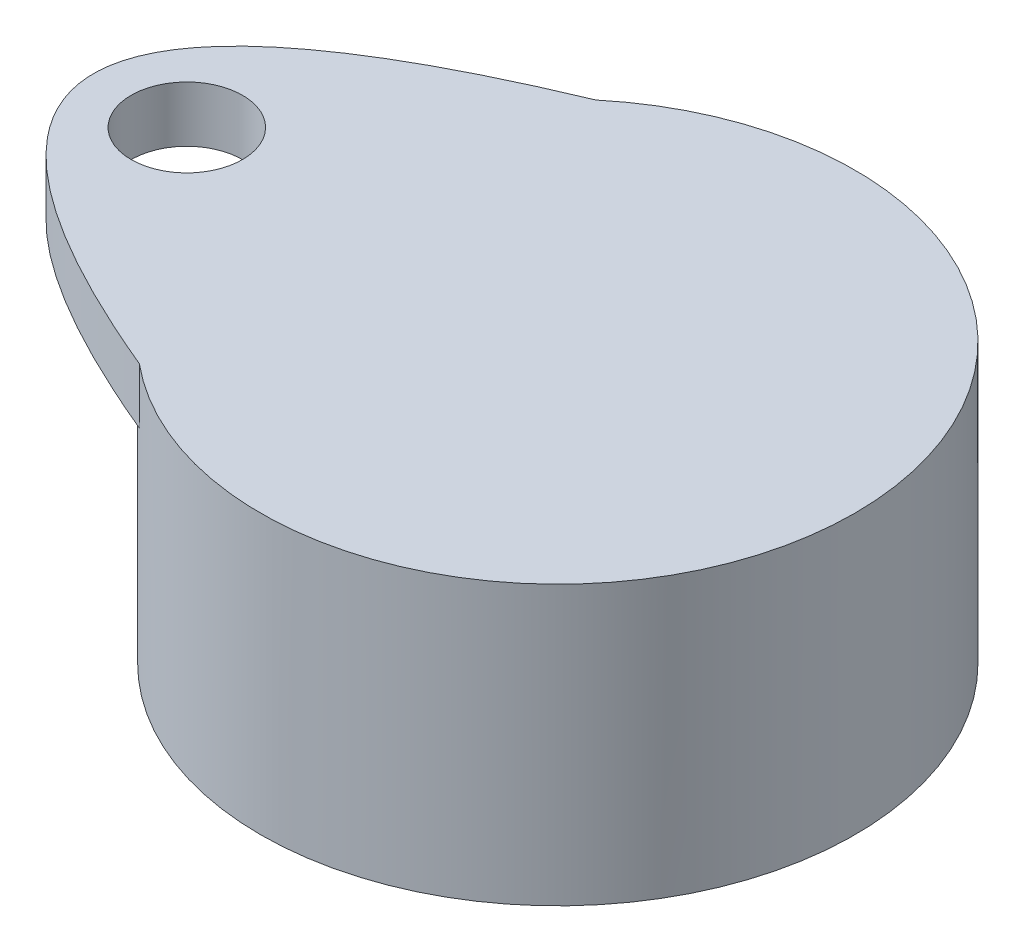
ISO-10303-21;
HEADER;
FILE_DESCRIPTION(('STEP AP214'),'2;1');
FILE_NAME('part.step','',(''),(''),'','','');
FILE_SCHEMA(('AUTOMOTIVE_DESIGN { 1 0 10303 214 1 1 1 1 }'));
ENDSEC;
DATA;
#1=APPLICATION_CONTEXT('core data for automotive mechanical design processes');
#2=APPLICATION_PROTOCOL_DEFINITION('international standard','automotive_design',2000,#1);
#3=PRODUCT_CONTEXT('',#1,'mechanical');
#4=PRODUCT('Part','Part','',(#3));
#5=PRODUCT_RELATED_PRODUCT_CATEGORY('part','',(#4));
#6=PRODUCT_DEFINITION_FORMATION('','',#4);
#7=PRODUCT_DEFINITION_CONTEXT('part definition',#1,'design');
#8=PRODUCT_DEFINITION('design','',#6,#7);
#9=PRODUCT_DEFINITION_SHAPE('','',#8);
#10=(LENGTH_UNIT() NAMED_UNIT(*) SI_UNIT(.MILLI.,.METRE.));
#11=(NAMED_UNIT(*) PLANE_ANGLE_UNIT() SI_UNIT($,.RADIAN.));
#12=(NAMED_UNIT(*) SI_UNIT($,.STERADIAN.) SOLID_ANGLE_UNIT());
#13=UNCERTAINTY_MEASURE_WITH_UNIT(LENGTH_MEASURE(1.E-05),#10,'distance_accuracy_value','');
#14=(GEOMETRIC_REPRESENTATION_CONTEXT(3) GLOBAL_UNCERTAINTY_ASSIGNED_CONTEXT((#13)) GLOBAL_UNIT_ASSIGNED_CONTEXT((#10,
#11,#12)) REPRESENTATION_CONTEXT('',''));
#15=CARTESIAN_POINT('',(0.,0.,0.));
#16=DIRECTION('',(0.,0.,1.));
#17=DIRECTION('',(1.,0.,0.));
#18=AXIS2_PLACEMENT_3D('',#15,#16,#17);
#19=CARTESIAN_POINT('',(0.,12.,0.));
#20=DIRECTION('',(0.,-1.,0.));
#21=DIRECTION('',(0.,0.,-1.));
#22=AXIS2_PLACEMENT_3D('',#19,#20,#21);
#23=CYLINDRICAL_SURFACE('',#22,16.);
#24=CARTESIAN_POINT('',(0.,12.,0.));
#25=DIRECTION('',(0.,1.,0.));
#26=DIRECTION('',(0.,0.,1.));
#27=AXIS2_PLACEMENT_3D('',#24,#25,#26);
#28=CIRCLE('',#27,16.);
#29=CARTESIAN_POINT('',(-10.2399999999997,12.,-12.2939985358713));
#30=VERTEX_POINT('',#29);
#31=CARTESIAN_POINT('',(-10.2399999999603,12.,12.2939985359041));
#32=VERTEX_POINT('',#31);
#33=EDGE_CURVE('E11',#30,#32,#28,.T.);
#34=ORIENTED_EDGE('',*,*,#33,.F.);
#35=DIRECTION('',(0.,-1.,0.));
#36=VECTOR('',#35,1.);
#37=CARTESIAN_POINT('',(-10.2399999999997,15.,-12.2939985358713));
#38=LINE('',#37,#36);
#39=CARTESIAN_POINT('',(-10.2399999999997,15.,-12.2939985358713));
#40=VERTEX_POINT('',#39);
#41=EDGE_CURVE('E59',#40,#30,#38,.T.);
#42=ORIENTED_EDGE('',*,*,#41,.F.);
#43=CARTESIAN_POINT('',(0.,15.,0.));
#44=DIRECTION('',(0.,1.,0.));
#45=DIRECTION('',(0.,0.,1.));
#46=AXIS2_PLACEMENT_3D('',#43,#44,#45);
#47=CIRCLE('',#46,15.9999999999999);
#48=CARTESIAN_POINT('',(-10.2399999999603,15.,12.2939985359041));
#49=VERTEX_POINT('',#48);
#50=EDGE_CURVE('E52',#49,#40,#47,.T.);
#51=ORIENTED_EDGE('',*,*,#50,.F.);
#52=DIRECTION('',(0.,-1.,0.));
#53=VECTOR('',#52,1.);
#54=CARTESIAN_POINT('',(-10.2399999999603,15.,12.2939985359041));
#55=LINE('',#54,#53);
#56=EDGE_CURVE('E62',#49,#32,#55,.T.);
#57=ORIENTED_EDGE('',*,*,#56,.T.);
#58=EDGE_LOOP('',(#34,#42,#51,#57));
#59=FACE_BOUND('',#58,.T.);
#60=CARTESIAN_POINT('',(0.,0.,0.));
#61=DIRECTION('',(0.,1.,0.));
#62=DIRECTION('',(0.,0.,1.));
#63=AXIS2_PLACEMENT_3D('',#60,#61,#62);
#64=CIRCLE('',#63,16.);
#65=CARTESIAN_POINT('',(0.,0.,16.));
#66=VERTEX_POINT('',#65);
#67=EDGE_CURVE('E36',#66,#66,#64,.T.);
#68=ORIENTED_EDGE('',*,*,#67,.T.);
#69=EDGE_LOOP('',(#68));
#70=FACE_BOUND('',#69,.T.);
#71=ADVANCED_FACE('F33',(#59,#70),#23,.T.);
#72=CARTESIAN_POINT('',(0.,0.,0.));
#73=DIRECTION('',(0.,1.,0.));
#74=DIRECTION('',(0.,0.,1.));
#75=AXIS2_PLACEMENT_3D('',#72,#73,#74);
#76=PLANE('',#75);
#77=CARTESIAN_POINT('',(0.,0.,0.));
#78=DIRECTION('',(0.,-1.,0.));
#79=DIRECTION('',(0.,0.,-1.));
#80=AXIS2_PLACEMENT_3D('',#77,#78,#79);
#81=CIRCLE('',#80,11.75);
#82=CARTESIAN_POINT('',(0.,0.,-11.75));
#83=VERTEX_POINT('',#82);
#84=EDGE_CURVE('E84',#83,#83,#81,.T.);
#85=ORIENTED_EDGE('',*,*,#84,.F.);
#86=EDGE_LOOP('',(#85));
#87=FACE_BOUND('',#86,.T.);
#88=ORIENTED_EDGE('',*,*,#67,.F.);
#89=EDGE_LOOP('',(#88));
#90=FACE_BOUND('',#89,.T.);
#91=ADVANCED_FACE('F93',(#87,#90),#76,.F.);
#92=CARTESIAN_POINT('',(0.,5.,0.));
#93=DIRECTION('',(0.,-1.,0.));
#94=DIRECTION('',(0.,0.,-1.));
#95=AXIS2_PLACEMENT_3D('',#92,#93,#94);
#96=CYLINDRICAL_SURFACE('',#95,11.75);
#97=CARTESIAN_POINT('',(0.,5.,0.));
#98=DIRECTION('',(0.,-1.,0.));
#99=DIRECTION('',(0.,0.,-1.));
#100=AXIS2_PLACEMENT_3D('',#97,#98,#99);
#101=CIRCLE('',#100,11.75);
#102=CARTESIAN_POINT('',(0.,5.,-11.75));
#103=VERTEX_POINT('',#102);
#104=EDGE_CURVE('E85',#103,#103,#101,.T.);
#105=ORIENTED_EDGE('',*,*,#104,.F.);
#106=EDGE_LOOP('',(#105));
#107=FACE_BOUND('',#106,.T.);
#108=ORIENTED_EDGE('',*,*,#84,.T.);
#109=EDGE_LOOP('',(#108));
#110=FACE_BOUND('',#109,.T.);
#111=ADVANCED_FACE('F91',(#107,#110),#96,.F.);
#112=CARTESIAN_POINT('',(0.,5.,0.));
#113=DIRECTION('',(0.,-1.,0.));
#114=DIRECTION('',(0.,0.,-1.));
#115=AXIS2_PLACEMENT_3D('',#112,#113,#114);
#116=PLANE('',#115);
#117=ORIENTED_EDGE('',*,*,#104,.T.);
#118=EDGE_LOOP('',(#117));
#119=FACE_BOUND('',#118,.T.);
#120=ADVANCED_FACE('F113',(#119),#116,.T.);
#121=CARTESIAN_POINT('',(-10.2399999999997,15.,-12.2939985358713));
#122=CARTESIAN_POINT('',(-20.0800000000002,15.,-8.19599902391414));
#123=CARTESIAN_POINT('',(-29.9199999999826,15.,2.21218561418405E-11));
#124=CARTESIAN_POINT('',(-20.0800000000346,15.,8.19599902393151));
#125=CARTESIAN_POINT('',(-10.2399999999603,15.,12.2939985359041));
#126=B_SPLINE_CURVE_WITH_KNOTS('',3,(#121,#122,#123,#124,#125),.UNSPECIFIED.,.F.,.F.,(4,1,4),
(0.11581254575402,0.5,0.884187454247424),.UNSPECIFIED.);
#127=DIRECTION('',(0.,-1.,0.));
#128=VECTOR('',#127,1.);
#129=SURFACE_OF_LINEAR_EXTRUSION('',#126,#128);
#130=CARTESIAN_POINT('',(-10.2399999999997,12.,-12.2939985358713));
#131=CARTESIAN_POINT('',(-20.0800000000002,12.,-8.19599902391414));
#132=CARTESIAN_POINT('',(-29.9199999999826,12.,2.21218561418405E-11));
#133=CARTESIAN_POINT('',(-20.0800000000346,12.,8.19599902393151));
#134=CARTESIAN_POINT('',(-10.2399999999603,12.,12.2939985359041));
#135=B_SPLINE_CURVE_WITH_KNOTS('',3,(#130,#131,#132,#133,#134),.UNSPECIFIED.,.F.,.F.,(4,1,4),
(0.11581254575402,0.5,0.884187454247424),.UNSPECIFIED.);
#136=EDGE_CURVE('E66',#30,#32,#135,.T.);
#137=ORIENTED_EDGE('',*,*,#136,.T.);
#138=ORIENTED_EDGE('',*,*,#56,.F.);
#139=EDGE_CURVE('E67',#40,#49,#126,.T.);
#140=ORIENTED_EDGE('',*,*,#139,.F.);
#141=ORIENTED_EDGE('',*,*,#41,.T.);
#142=EDGE_LOOP('',(#137,#138,#140,#141));
#143=FACE_BOUND('',#142,.T.);
#144=ADVANCED_FACE('F65',(#143),#129,.F.);
#145=CARTESIAN_POINT('',(-25.,15.,2.31050098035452E-11));
#146=DIRECTION('',(0.,-1.,0.));
#147=DIRECTION('',(0.,0.,-1.));
#148=AXIS2_PLACEMENT_3D('',#145,#146,#147);
#149=PLANE('',#148);
#150=CARTESIAN_POINT('',(-19.97608013,15.,0.));
#151=DIRECTION('',(0.,1.,0.));
#152=DIRECTION('',(0.,0.,1.));
#153=AXIS2_PLACEMENT_3D('',#150,#151,#152);
#154=CIRCLE('',#153,3.);
#155=CARTESIAN_POINT('',(-19.97608013,15.,3.));
#156=VERTEX_POINT('',#155);
#157=EDGE_CURVE('E74',#156,#156,#154,.T.);
#158=ORIENTED_EDGE('',*,*,#157,.F.);
#159=EDGE_LOOP('',(#158));
#160=FACE_BOUND('',#159,.T.);
#161=ORIENTED_EDGE('',*,*,#139,.T.);
#162=ORIENTED_EDGE('',*,*,#50,.T.);
#163=EDGE_LOOP('',(#161,#162));
#164=FACE_BOUND('',#163,.T.);
#165=ADVANCED_FACE('F126',(#160,#164),#149,.F.);
#166=CARTESIAN_POINT('',(-25.,12.,2.31050098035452E-11));
#167=DIRECTION('',(0.,-1.,0.));
#168=DIRECTION('',(0.,0.,-1.));
#169=AXIS2_PLACEMENT_3D('',#166,#167,#168);
#170=PLANE('',#169);
#171=CARTESIAN_POINT('',(-19.97608013,12.,0.));
#172=DIRECTION('',(0.,1.,0.));
#173=DIRECTION('',(0.,0.,1.));
#174=AXIS2_PLACEMENT_3D('',#171,#172,#173);
#175=CIRCLE('',#174,3.);
#176=CARTESIAN_POINT('',(-19.97608013,12.,3.));
#177=VERTEX_POINT('',#176);
#178=EDGE_CURVE('E70',#177,#177,#175,.T.);
#179=ORIENTED_EDGE('',*,*,#178,.T.);
#180=EDGE_LOOP('',(#179));
#181=FACE_BOUND('',#180,.T.);
#182=ORIENTED_EDGE('',*,*,#136,.F.);
#183=ORIENTED_EDGE('',*,*,#33,.T.);
#184=EDGE_LOOP('',(#182,#183));
#185=FACE_BOUND('',#184,.T.);
#186=ADVANCED_FACE('F69',(#181,#185),#170,.T.);
#187=CARTESIAN_POINT('',(-19.97608013,12.,0.));
#188=DIRECTION('',(0.,1.,0.));
#189=DIRECTION('',(0.,0.,1.));
#190=AXIS2_PLACEMENT_3D('',#187,#188,#189);
#191=CYLINDRICAL_SURFACE('',#190,3.);
#192=ORIENTED_EDGE('',*,*,#178,.F.);
#193=EDGE_LOOP('',(#192));
#194=FACE_BOUND('',#193,.T.);
#195=ORIENTED_EDGE('',*,*,#157,.T.);
#196=EDGE_LOOP('',(#195));
#197=FACE_BOUND('',#196,.T.);
#198=ADVANCED_FACE('F140',(#194,#197),#191,.F.);
#199=CLOSED_SHELL('',(#71,#91,#111,#120,#144,#165,#186,#198));
#200=MANIFOLD_SOLID_BREP('B2',#199);
#201=ADVANCED_BREP_SHAPE_REPRESENTATION('',(#18,#200),#14);
#202=SHAPE_DEFINITION_REPRESENTATION(#9,#201);
ENDSEC;
END-ISO-10303-21;
